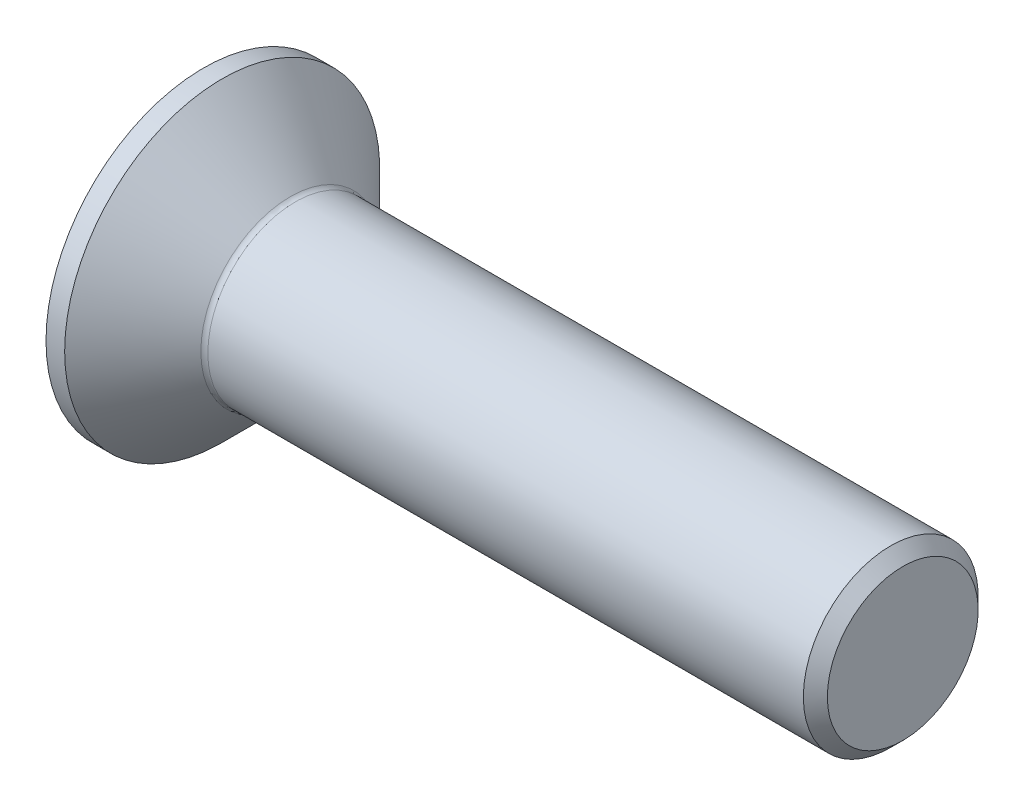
from build123d import *

# Parameters (mm, degrees)
FILLET1_R   = 0.8
HEX_2_DEPTH = 5.6


with BuildPart() as part:
    # BodySke → BaseBody (revolve)
    with BuildSketch(Plane.XY, mode=Mode.PRIVATE) as basebody_sk:
        Polygon((0, 0), (0, 18.025), (2.135, 18.025), (10.16, 10), (78.626, 10), (80, 8.626), (80, 0), align=None)
    revolve(basebody_sk.sketch.rotate(Axis((0, 0, 0), (1, 0, 0)), 90), axis=Axis((0, 0, 0), (1, 0, 0)))

    # Fillet1
    fillet1_edges = [part.edges().sort_by_distance(p)[0] for p in [
        (10.16, 0, -10),
    ]]
    fillet(fillet1_edges, radius=FILLET1_R)

    # Sketch2 → PreBroach (revolve, cut)
    with BuildSketch(Plane.XY, mode=Mode.PRIVATE) as prebroach_sk:
        Polygon((0, 6), (5.6, 6), (9.064101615, 0), (0, 0), align=None)
    revolve(prebroach_sk.sketch.rotate(Axis((0, 0, 0), (1, 0, 0)), 90), axis=Axis((0, 0, 0), (1, 0, 0)), mode=Mode.SUBTRACT)

    # Sketch3 → Hex 2 (cut)
    with BuildSketch(Plane.ZY):
        Polygon((-6, -3.464101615), (-6, 3.464101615), (0, 6.92820323), (6, 3.464101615), (6, -3.464101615), (0, -6.92820323), align=None)
    extrude(amount=-HEX_2_DEPTH, mode=Mode.SUBTRACT)


solid = part.part
